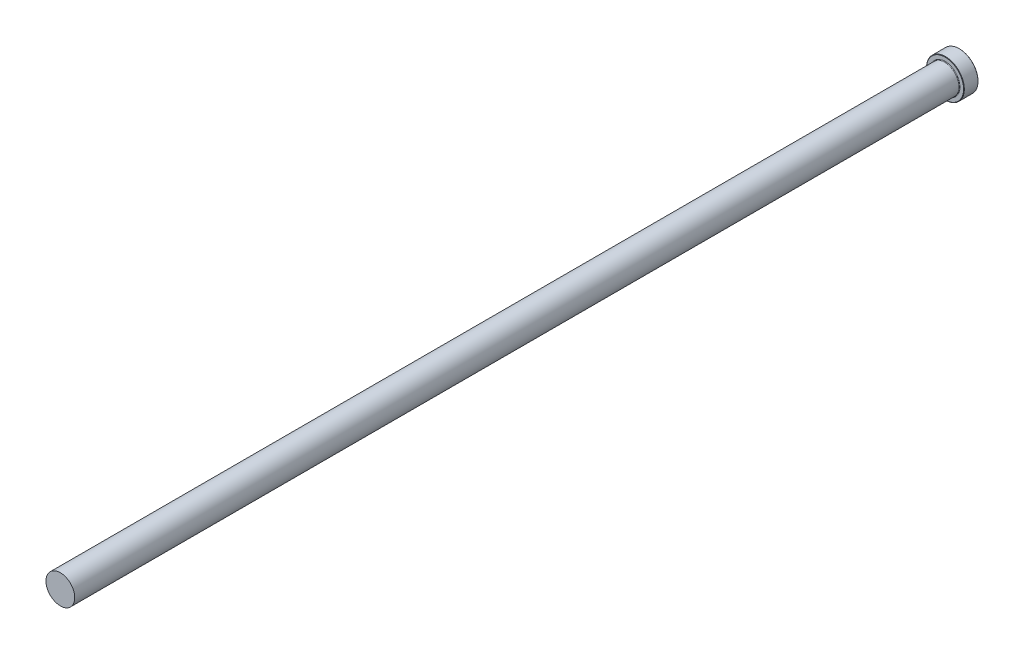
ISO-10303-21;
HEADER;
FILE_DESCRIPTION(('STEP AP214'),'2;1');
FILE_NAME('part.step','',(''),(''),'','','');
FILE_SCHEMA(('AUTOMOTIVE_DESIGN { 1 0 10303 214 1 1 1 1 }'));
ENDSEC;
DATA;
#1=APPLICATION_CONTEXT('core data for automotive mechanical design processes');
#2=APPLICATION_PROTOCOL_DEFINITION('international standard','automotive_design',2000,#1);
#3=PRODUCT_CONTEXT('',#1,'mechanical');
#4=PRODUCT('Part','Part','',(#3));
#5=PRODUCT_RELATED_PRODUCT_CATEGORY('part','',(#4));
#6=PRODUCT_DEFINITION_FORMATION('','',#4);
#7=PRODUCT_DEFINITION_CONTEXT('part definition',#1,'design');
#8=PRODUCT_DEFINITION('design','',#6,#7);
#9=PRODUCT_DEFINITION_SHAPE('','',#8);
#10=(LENGTH_UNIT() NAMED_UNIT(*) SI_UNIT(.MILLI.,.METRE.));
#11=(NAMED_UNIT(*) PLANE_ANGLE_UNIT() SI_UNIT($,.RADIAN.));
#12=(NAMED_UNIT(*) SI_UNIT($,.STERADIAN.) SOLID_ANGLE_UNIT());
#13=UNCERTAINTY_MEASURE_WITH_UNIT(LENGTH_MEASURE(1.E-05),#10,'distance_accuracy_value','');
#14=(GEOMETRIC_REPRESENTATION_CONTEXT(3) GLOBAL_UNCERTAINTY_ASSIGNED_CONTEXT((#13)) GLOBAL_UNIT_ASSIGNED_CONTEXT((#10,
#11,#12)) REPRESENTATION_CONTEXT('',''));
#15=CARTESIAN_POINT('',(0.,0.,0.));
#16=DIRECTION('',(0.,0.,1.));
#17=DIRECTION('',(1.,0.,0.));
#18=AXIS2_PLACEMENT_3D('',#15,#16,#17);
#19=CARTESIAN_POINT('',(0.,7.99999999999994,500.));
#20=DIRECTION('',(0.,0.,-1.));
#21=DIRECTION('',(-1.,0.,0.));
#22=AXIS2_PLACEMENT_3D('',#19,#20,#21);
#23=PLANE('',#22);
#24=CARTESIAN_POINT('',(0.,0.,500.));
#25=DIRECTION('',(0.,0.,1.));
#26=DIRECTION('',(1.,0.,0.));
#27=AXIS2_PLACEMENT_3D('',#24,#25,#26);
#28=CIRCLE('',#27,7.99999999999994);
#29=CARTESIAN_POINT('',(7.99999999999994,0.,500.));
#30=VERTEX_POINT('',#29);
#31=EDGE_CURVE('E50',#30,#30,#28,.T.);
#32=ORIENTED_EDGE('',*,*,#31,.T.);
#33=EDGE_LOOP('',(#32));
#34=FACE_BOUND('',#33,.T.);
#35=ADVANCED_FACE('F30',(#34),#23,.F.);
#36=CARTESIAN_POINT('',(0.,0.,109.050628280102));
#37=DIRECTION('',(0.,0.,1.));
#38=DIRECTION('',(1.,0.,0.));
#39=AXIS2_PLACEMENT_3D('',#36,#37,#38);
#40=CYLINDRICAL_SURFACE('',#39,7.99999999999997);
#41=ORIENTED_EDGE('',*,*,#31,.F.);
#42=EDGE_LOOP('',(#41));
#43=FACE_BOUND('',#42,.T.);
#44=CARTESIAN_POINT('',(0.,0.,8.3));
#45=DIRECTION('',(0.,0.,1.));
#46=DIRECTION('',(1.,0.,0.));
#47=AXIS2_PLACEMENT_3D('',#44,#45,#46);
#48=CIRCLE('',#47,8.);
#49=CARTESIAN_POINT('',(8.,0.,8.3));
#50=VERTEX_POINT('',#49);
#51=EDGE_CURVE('E53',#50,#50,#48,.T.);
#52=ORIENTED_EDGE('',*,*,#51,.T.);
#53=EDGE_LOOP('',(#52));
#54=FACE_BOUND('',#53,.T.);
#55=ADVANCED_FACE('F73',(#43,#54),#40,.T.);
#56=CARTESIAN_POINT('',(0.,0.,8.3));
#57=DIRECTION('',(0.,0.,1.));
#58=DIRECTION('',(1.,0.,0.));
#59=AXIS2_PLACEMENT_3D('',#56,#57,#58);
#60=TOROIDAL_SURFACE('',#59,8.3,0.3);
#61=ORIENTED_EDGE('',*,*,#51,.F.);
#62=EDGE_LOOP('',(#61));
#63=FACE_BOUND('',#62,.T.);
#64=CARTESIAN_POINT('',(0.,0.,8.00000000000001));
#65=DIRECTION('',(0.,0.,1.));
#66=DIRECTION('',(1.,0.,0.));
#67=AXIS2_PLACEMENT_3D('',#64,#65,#66);
#68=CIRCLE('',#67,8.3);
#69=CARTESIAN_POINT('',(8.3,0.,8.00000000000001));
#70=VERTEX_POINT('',#69);
#71=EDGE_CURVE('E56',#70,#70,#68,.T.);
#72=ORIENTED_EDGE('',*,*,#71,.T.);
#73=EDGE_LOOP('',(#72));
#74=FACE_BOUND('',#73,.T.);
#75=ADVANCED_FACE('F60',(#63,#74),#60,.F.);
#76=CARTESIAN_POINT('',(0.,10.5,8.));
#77=DIRECTION('',(0.,0.,-1.));
#78=DIRECTION('',(-1.,0.,0.));
#79=AXIS2_PLACEMENT_3D('',#76,#77,#78);
#80=PLANE('',#79);
#81=CARTESIAN_POINT('',(0.,0.,8.));
#82=DIRECTION('',(0.,0.,-1.));
#83=DIRECTION('',(-1.,0.,0.));
#84=AXIS2_PLACEMENT_3D('',#81,#82,#83);
#85=CIRCLE('',#84,10.3);
#86=CARTESIAN_POINT('',(-10.3,0.,8.));
#87=VERTEX_POINT('',#86);
#88=EDGE_CURVE('E10',#87,#87,#85,.F.);
#89=ORIENTED_EDGE('',*,*,#88,.T.);
#90=EDGE_LOOP('',(#89));
#91=FACE_BOUND('',#90,.T.);
#92=ORIENTED_EDGE('',*,*,#71,.F.);
#93=EDGE_LOOP('',(#92));
#94=FACE_BOUND('',#93,.T.);
#95=ADVANCED_FACE('F62',(#91,#94),#80,.F.);
#96=CARTESIAN_POINT('',(0.,0.,109.050628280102));
#97=DIRECTION('',(0.,0.,1.));
#98=DIRECTION('',(1.,0.,0.));
#99=AXIS2_PLACEMENT_3D('',#96,#97,#98);
#100=CYLINDRICAL_SURFACE('',#99,10.5);
#101=CARTESIAN_POINT('',(0.,0.,0.199999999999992));
#102=DIRECTION('',(0.,0.,1.));
#103=DIRECTION('',(1.,0.,0.));
#104=AXIS2_PLACEMENT_3D('',#101,#102,#103);
#105=CIRCLE('',#104,10.5);
#106=CARTESIAN_POINT('',(10.5,0.,0.199999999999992));
#107=VERTEX_POINT('',#106);
#108=EDGE_CURVE('E41',#107,#107,#105,.T.);
#109=ORIENTED_EDGE('',*,*,#108,.T.);
#110=EDGE_LOOP('',(#109));
#111=FACE_BOUND('',#110,.T.);
#112=CARTESIAN_POINT('',(0.,0.,7.80000000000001));
#113=DIRECTION('',(0.,0.,-1.));
#114=DIRECTION('',(-1.,0.,0.));
#115=AXIS2_PLACEMENT_3D('',#112,#113,#114);
#116=CIRCLE('',#115,10.5);
#117=CARTESIAN_POINT('',(-10.5,0.,7.80000000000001));
#118=VERTEX_POINT('',#117);
#119=EDGE_CURVE('E45',#118,#118,#116,.T.);
#120=ORIENTED_EDGE('',*,*,#119,.T.);
#121=EDGE_LOOP('',(#120));
#122=FACE_BOUND('',#121,.T.);
#123=ADVANCED_FACE('F64',(#111,#122),#100,.T.);
#124=CARTESIAN_POINT('',(0.,0.,0.));
#125=DIRECTION('',(0.,0.,1.));
#126=DIRECTION('',(1.,0.,0.));
#127=AXIS2_PLACEMENT_3D('',#124,#125,#126);
#128=PLANE('',#127);
#129=CARTESIAN_POINT('',(0.,0.,0.));
#130=DIRECTION('',(0.,0.,1.));
#131=DIRECTION('',(1.,0.,0.));
#132=AXIS2_PLACEMENT_3D('',#129,#130,#131);
#133=CIRCLE('',#132,10.3);
#134=CARTESIAN_POINT('',(10.3,0.,0.));
#135=VERTEX_POINT('',#134);
#136=EDGE_CURVE('E37',#135,#135,#133,.F.);
#137=ORIENTED_EDGE('',*,*,#136,.T.);
#138=EDGE_LOOP('',(#137));
#139=FACE_BOUND('',#138,.T.);
#140=ADVANCED_FACE('F70',(#139),#128,.F.);
#141=CARTESIAN_POINT('',(0.,0.,0.199999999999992));
#142=DIRECTION('',(0.,0.,1.));
#143=DIRECTION('',(1.,0.,0.));
#144=AXIS2_PLACEMENT_3D('',#141,#142,#143);
#145=CONICAL_SURFACE('',#144,10.5,0.785398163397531);
#146=ORIENTED_EDGE('',*,*,#136,.F.);
#147=EDGE_LOOP('',(#146));
#148=FACE_BOUND('',#147,.T.);
#149=ORIENTED_EDGE('',*,*,#108,.F.);
#150=EDGE_LOOP('',(#149));
#151=FACE_BOUND('',#150,.T.);
#152=ADVANCED_FACE('F84',(#148,#151),#145,.T.);
#153=CARTESIAN_POINT('',(0.,0.,8.00000000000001));
#154=DIRECTION('',(0.,0.,-1.));
#155=DIRECTION('',(-1.,0.,0.));
#156=AXIS2_PLACEMENT_3D('',#153,#154,#155);
#157=CONICAL_SURFACE('',#156,10.3,0.785398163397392);
#158=ORIENTED_EDGE('',*,*,#119,.F.);
#159=EDGE_LOOP('',(#158));
#160=FACE_BOUND('',#159,.T.);
#161=ORIENTED_EDGE('',*,*,#88,.F.);
#162=EDGE_LOOP('',(#161));
#163=FACE_BOUND('',#162,.T.);
#164=ADVANCED_FACE('F32',(#160,#163),#157,.T.);
#165=CLOSED_SHELL('',(#35,#55,#75,#95,#123,#140,#152,#164));
#166=MANIFOLD_SOLID_BREP('B2',#165);
#167=ADVANCED_BREP_SHAPE_REPRESENTATION('',(#18,#166),#14);
#168=SHAPE_DEFINITION_REPRESENTATION(#9,#167);
ENDSEC;
END-ISO-10303-21;
